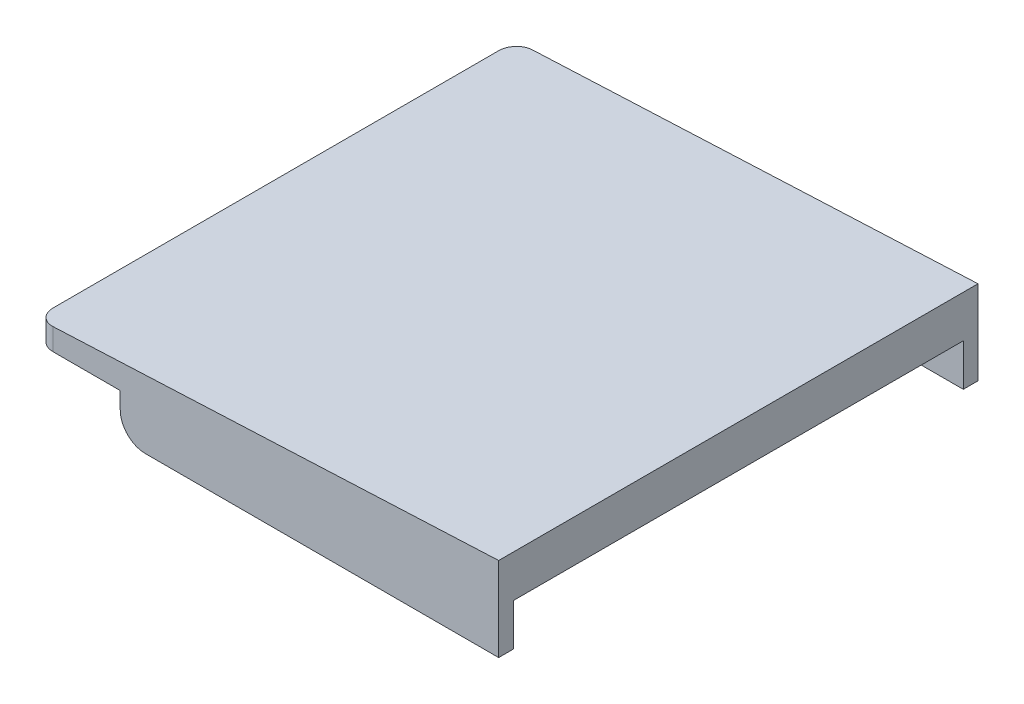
from build123d import *

# Parameters (mm, degrees)
EXTRUSION2_DEPTH = 57
COQUE1_T         = -2
CONG_1_R         = 2
ESQUISSE8_W      = 45
ESQUISSE8_H      = 1.75
EXTRUSION5_DEPTH = 5
CONG_2_R         = 3


with BuildPart() as part:
    # Esquisse4 → Extrusion2 (new body)
    with BuildSketch(Plane.XY):
        Polygon((0, 2.5), (55, 5), (55, 0), (0, 0), align=None)
    extrude(amount=EXTRUSION2_DEPTH)

    # Coque1
    coque1_openings = [part.faces().sort_by_distance(p)[0] for p in [
        (27.5, 0, 28.5),
    ]]
    offset(amount=COQUE1_T, openings=coque1_openings, kind=Kind.INTERSECTION)

    # Cong_1
    cong_1_edges = [part.edges().sort_by_distance(p)[0] for p in [
        (0, 1.25, 57),
        (0, 1.25, 0),
    ]]
    fillet(cong_1_edges, radius=CONG_1_R)

    # Esquisse8 → Extrusion5 (add)
    with BuildSketch(Plane.XZ):
        with Locations((32.5, 0.875)):
            Rectangle(ESQUISSE8_W, ESQUISSE8_H)
        with Locations((32.5, 56.125)):
            Rectangle(ESQUISSE8_W, ESQUISSE8_H)
    extrude(amount=EXTRUSION5_DEPTH)

    # Cong_2
    cong_2_edges = [part.edges().sort_by_distance(p)[0] for p in [
        (10, -5, 0.875),
        (10, -5, 56.125),
    ]]
    fillet(cong_2_edges, radius=CONG_2_R)


solid = part.part
